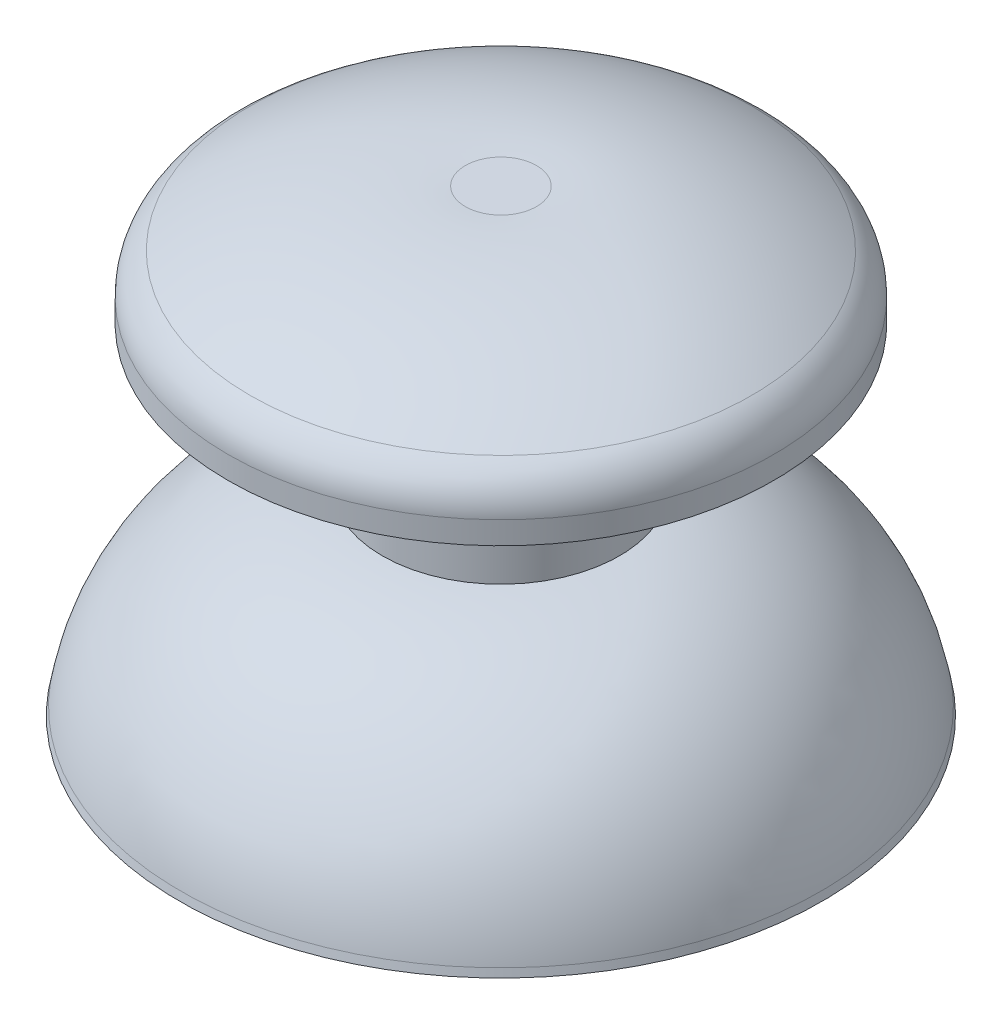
ISO-10303-21;
HEADER;
FILE_DESCRIPTION(('STEP AP214'),'2;1');
FILE_NAME('part.step','',(''),(''),'','','');
FILE_SCHEMA(('AUTOMOTIVE_DESIGN { 1 0 10303 214 1 1 1 1 }'));
ENDSEC;
DATA;
#1=APPLICATION_CONTEXT('core data for automotive mechanical design processes');
#2=APPLICATION_PROTOCOL_DEFINITION('international standard','automotive_design',2000,#1);
#3=PRODUCT_CONTEXT('',#1,'mechanical');
#4=PRODUCT('Part','Part','',(#3));
#5=PRODUCT_RELATED_PRODUCT_CATEGORY('part','',(#4));
#6=PRODUCT_DEFINITION_FORMATION('','',#4);
#7=PRODUCT_DEFINITION_CONTEXT('part definition',#1,'design');
#8=PRODUCT_DEFINITION('design','',#6,#7);
#9=PRODUCT_DEFINITION_SHAPE('','',#8);
#10=(LENGTH_UNIT() NAMED_UNIT(*) SI_UNIT(.MILLI.,.METRE.));
#11=(NAMED_UNIT(*) PLANE_ANGLE_UNIT() SI_UNIT($,.RADIAN.));
#12=(NAMED_UNIT(*) SI_UNIT($,.STERADIAN.) SOLID_ANGLE_UNIT());
#13=UNCERTAINTY_MEASURE_WITH_UNIT(LENGTH_MEASURE(1.E-05),#10,'distance_accuracy_value','');
#14=(GEOMETRIC_REPRESENTATION_CONTEXT(3) GLOBAL_UNCERTAINTY_ASSIGNED_CONTEXT((#13)) GLOBAL_UNIT_ASSIGNED_CONTEXT((#10,
#11,#12)) REPRESENTATION_CONTEXT('',''));
#15=CARTESIAN_POINT('',(0.,0.,0.));
#16=DIRECTION('',(0.,0.,1.));
#17=DIRECTION('',(1.,0.,0.));
#18=AXIS2_PLACEMENT_3D('',#15,#16,#17);
#19=CARTESIAN_POINT('',(0.,47.1009103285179,0.));
#20=DIRECTION('',(0.,-1.,0.));
#21=DIRECTION('',(0.,0.,-1.));
#22=AXIS2_PLACEMENT_3D('',#19,#20,#21);
#23=DEGENERATE_TOROIDAL_SURFACE('',#22,2.30924753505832,15.52,.T.);
#24=CARTESIAN_POINT('',(0.,60.239797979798,0.));
#25=DIRECTION('',(0.,-1.,0.));
#26=DIRECTION('',(0.,0.,-1.));
#27=AXIS2_PLACEMENT_3D('',#24,#25,#26);
#28=CIRCLE('',#27,10.57);
#29=CARTESIAN_POINT('',(0.,60.239797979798,-10.57));
#30=VERTEX_POINT('',#29);
#31=EDGE_CURVE('E67',#30,#30,#28,.T.);
#32=ORIENTED_EDGE('',*,*,#31,.F.);
#33=EDGE_LOOP('',(#32));
#34=FACE_BOUND('',#33,.T.);
#35=CARTESIAN_POINT('',(0.,62.599797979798,0.));
#36=DIRECTION('',(0.,-1.,0.));
#37=DIRECTION('',(0.,0.,-1.));
#38=AXIS2_PLACEMENT_3D('',#35,#36,#37);
#39=CIRCLE('',#38,1.5);
#40=CARTESIAN_POINT('',(0.,62.599797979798,-1.5));
#41=VERTEX_POINT('',#40);
#42=EDGE_CURVE('E10',#41,#41,#39,.T.);
#43=ORIENTED_EDGE('',*,*,#42,.T.);
#44=EDGE_LOOP('',(#43));
#45=FACE_BOUND('',#44,.T.);
#46=ADVANCED_FACE('F24',(#34,#45),#23,.T.);
#47=CARTESIAN_POINT('',(6.775,62.599797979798,0.));
#48=DIRECTION('',(0.,-1.,0.));
#49=DIRECTION('',(0.,0.,-1.));
#50=AXIS2_PLACEMENT_3D('',#47,#48,#49);
#51=PLANE('',#50);
#52=ORIENTED_EDGE('',*,*,#42,.F.);
#53=EDGE_LOOP('',(#52));
#54=FACE_BOUND('',#53,.T.);
#55=ADVANCED_FACE('F74',(#54),#51,.F.);
#56=CARTESIAN_POINT('',(6.775,53.429797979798,0.));
#57=DIRECTION('',(0.,-1.,0.));
#58=DIRECTION('',(0.,0.,-1.));
#59=AXIS2_PLACEMENT_3D('',#56,#57,#58);
#60=PLANE('',#59);
#61=CARTESIAN_POINT('',(0.,53.429797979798,0.));
#62=DIRECTION('',(0.,-1.,0.));
#63=DIRECTION('',(0.,0.,-1.));
#64=AXIS2_PLACEMENT_3D('',#61,#62,#63);
#65=CIRCLE('',#64,1.61);
#66=CARTESIAN_POINT('',(0.,53.429797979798,-1.61));
#67=VERTEX_POINT('',#66);
#68=EDGE_CURVE('E30',#67,#67,#65,.T.);
#69=ORIENTED_EDGE('',*,*,#68,.T.);
#70=EDGE_LOOP('',(#69));
#71=FACE_BOUND('',#70,.T.);
#72=ADVANCED_FACE('F78',(#71),#60,.T.);
#73=CARTESIAN_POINT('',(0.,0.,0.));
#74=DIRECTION('',(0.,-1.,0.));
#75=DIRECTION('',(0.,0.,-1.));
#76=AXIS2_PLACEMENT_3D('',#73,#74,#75);
#77=CYLINDRICAL_SURFACE('',#76,1.61);
#78=CARTESIAN_POINT('',(0.,48.509797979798,0.));
#79=DIRECTION('',(0.,-1.,0.));
#80=DIRECTION('',(0.,0.,-1.));
#81=AXIS2_PLACEMENT_3D('',#78,#79,#80);
#82=CIRCLE('',#81,1.61);
#83=CARTESIAN_POINT('',(0.,48.509797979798,-1.61));
#84=VERTEX_POINT('',#83);
#85=EDGE_CURVE('E34',#84,#84,#82,.T.);
#86=ORIENTED_EDGE('',*,*,#85,.T.);
#87=EDGE_LOOP('',(#86));
#88=FACE_BOUND('',#87,.T.);
#89=ORIENTED_EDGE('',*,*,#68,.F.);
#90=EDGE_LOOP('',(#89));
#91=FACE_BOUND('',#90,.T.);
#92=ADVANCED_FACE('F83',(#88,#91),#77,.F.);
#93=CARTESIAN_POINT('',(6.775,48.509797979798,0.));
#94=DIRECTION('',(0.,-1.,0.));
#95=DIRECTION('',(0.,0.,-1.));
#96=AXIS2_PLACEMENT_3D('',#93,#94,#95);
#97=PLANE('',#96);
#98=CARTESIAN_POINT('',(0.,48.509797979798,0.));
#99=DIRECTION('',(0.,-1.,0.));
#100=DIRECTION('',(0.,0.,-1.));
#101=AXIS2_PLACEMENT_3D('',#98,#99,#100);
#102=CIRCLE('',#101,8.82);
#103=CARTESIAN_POINT('',(0.,48.509797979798,-8.82));
#104=VERTEX_POINT('',#103);
#105=EDGE_CURVE('E38',#104,#104,#102,.T.);
#106=ORIENTED_EDGE('',*,*,#105,.T.);
#107=EDGE_LOOP('',(#106));
#108=FACE_BOUND('',#107,.T.);
#109=ORIENTED_EDGE('',*,*,#85,.F.);
#110=EDGE_LOOP('',(#109));
#111=FACE_BOUND('',#110,.T.);
#112=ADVANCED_FACE('F88',(#108,#111),#97,.T.);
#113=CARTESIAN_POINT('',(0.,41.8535641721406,0.));
#114=DIRECTION('',(0.,-1.,0.));
#115=DIRECTION('',(0.,0.,-1.));
#116=AXIS2_PLACEMENT_3D('',#113,#114,#115);
#117=DEGENERATE_TOROIDAL_SURFACE('',#116,3.86171889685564,8.3,.T.);
#118=CARTESIAN_POINT('',(0.,43.599797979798,0.));
#119=DIRECTION('',(0.,-1.,0.));
#120=DIRECTION('',(0.,0.,-1.));
#121=AXIS2_PLACEMENT_3D('',#118,#119,#120);
#122=CIRCLE('',#121,11.9759451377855);
#123=CARTESIAN_POINT('',(0.,43.599797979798,-11.9759451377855));
#124=VERTEX_POINT('',#123);
#125=EDGE_CURVE('E43',#124,#124,#122,.T.);
#126=ORIENTED_EDGE('',*,*,#125,.T.);
#127=EDGE_LOOP('',(#126));
#128=FACE_BOUND('',#127,.T.);
#129=ORIENTED_EDGE('',*,*,#105,.F.);
#130=EDGE_LOOP('',(#129));
#131=FACE_BOUND('',#130,.T.);
#132=ADVANCED_FACE('F92',(#128,#131),#117,.F.);
#133=CARTESIAN_POINT('',(0.,43.599797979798,0.));
#134=DIRECTION('',(0.,-1.,0.));
#135=DIRECTION('',(0.,0.,-1.));
#136=AXIS2_PLACEMENT_3D('',#133,#134,#135);
#137=CONICAL_SURFACE('',#136,11.9759451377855,0.191721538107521);
#138=CARTESIAN_POINT('',(0.,43.269797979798,0.));
#139=DIRECTION('',(0.,-1.,0.));
#140=DIRECTION('',(0.,0.,-1.));
#141=AXIS2_PLACEMENT_3D('',#138,#139,#140);
#142=CIRCLE('',#141,12.04);
#143=CARTESIAN_POINT('',(0.,43.269797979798,-12.04));
#144=VERTEX_POINT('',#143);
#145=EDGE_CURVE('E46',#144,#144,#142,.T.);
#146=ORIENTED_EDGE('',*,*,#145,.T.);
#147=EDGE_LOOP('',(#146));
#148=FACE_BOUND('',#147,.T.);
#149=ORIENTED_EDGE('',*,*,#125,.F.);
#150=EDGE_LOOP('',(#149));
#151=FACE_BOUND('',#150,.T.);
#152=ADVANCED_FACE('F96',(#148,#151),#137,.F.);
#153=CARTESIAN_POINT('',(6.775,43.269797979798,0.));
#154=DIRECTION('',(0.,-1.,0.));
#155=DIRECTION('',(0.,0.,-1.));
#156=AXIS2_PLACEMENT_3D('',#153,#154,#155);
#157=PLANE('',#156);
#158=CARTESIAN_POINT('',(0.,43.269797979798,0.));
#159=DIRECTION('',(0.,-1.,0.));
#160=DIRECTION('',(0.,0.,-1.));
#161=AXIS2_PLACEMENT_3D('',#158,#159,#160);
#162=CIRCLE('',#161,13.55);
#163=CARTESIAN_POINT('',(0.,43.269797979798,-13.55));
#164=VERTEX_POINT('',#163);
#165=EDGE_CURVE('E49',#164,#164,#162,.T.);
#166=ORIENTED_EDGE('',*,*,#165,.T.);
#167=EDGE_LOOP('',(#166));
#168=FACE_BOUND('',#167,.T.);
#169=ORIENTED_EDGE('',*,*,#145,.F.);
#170=EDGE_LOOP('',(#169));
#171=FACE_BOUND('',#170,.T.);
#172=ADVANCED_FACE('F100',(#168,#171),#157,.T.);
#173=CARTESIAN_POINT('',(0.,43.599797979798,0.));
#174=DIRECTION('',(0.,-1.,0.));
#175=DIRECTION('',(0.,0.,-1.));
#176=AXIS2_PLACEMENT_3D('',#173,#174,#175);
#177=CONICAL_SURFACE('',#176,13.4859451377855,0.191721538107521);
#178=ORIENTED_EDGE('',*,*,#165,.F.);
#179=EDGE_LOOP('',(#178));
#180=FACE_BOUND('',#179,.T.);
#181=CARTESIAN_POINT('',(0.,43.599797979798,0.));
#182=DIRECTION('',(0.,-1.,0.));
#183=DIRECTION('',(0.,0.,-1.));
#184=AXIS2_PLACEMENT_3D('',#181,#182,#183);
#185=CIRCLE('',#184,13.4859451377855);
#186=CARTESIAN_POINT('',(0.,43.599797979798,-13.4859451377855));
#187=VERTEX_POINT('',#186);
#188=EDGE_CURVE('E52',#187,#187,#185,.T.);
#189=ORIENTED_EDGE('',*,*,#188,.T.);
#190=EDGE_LOOP('',(#189));
#191=FACE_BOUND('',#190,.T.);
#192=ADVANCED_FACE('F104',(#180,#191),#177,.T.);
#193=CARTESIAN_POINT('',(0.,41.8686870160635,0.));
#194=DIRECTION('',(0.,-1.,0.));
#195=DIRECTION('',(0.,0.,-1.));
#196=AXIS2_PLACEMENT_3D('',#193,#194,#195);
#197=DEGENERATE_TOROIDAL_SURFACE('',#196,3.84005197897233,9.8,.T.);
#198=ORIENTED_EDGE('',*,*,#188,.F.);
#199=EDGE_LOOP('',(#198));
#200=FACE_BOUND('',#199,.T.);
#201=CARTESIAN_POINT('',(0.,51.599797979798,0.));
#202=DIRECTION('',(0.,-1.,0.));
#203=DIRECTION('',(0.,0.,-1.));
#204=AXIS2_PLACEMENT_3D('',#201,#202,#203);
#205=CIRCLE('',#204,5.);
#206=CARTESIAN_POINT('',(0.,51.599797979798,-5.));
#207=VERTEX_POINT('',#206);
#208=EDGE_CURVE('E55',#207,#207,#205,.T.);
#209=ORIENTED_EDGE('',*,*,#208,.T.);
#210=EDGE_LOOP('',(#209));
#211=FACE_BOUND('',#210,.T.);
#212=ADVANCED_FACE('F108',(#200,#211),#197,.T.);
#213=CARTESIAN_POINT('',(0.,0.,0.));
#214=DIRECTION('',(0.,-1.,0.));
#215=DIRECTION('',(0.,0.,-1.));
#216=AXIS2_PLACEMENT_3D('',#213,#214,#215);
#217=CYLINDRICAL_SURFACE('',#216,5.);
#218=ORIENTED_EDGE('',*,*,#208,.F.);
#219=EDGE_LOOP('',(#218));
#220=FACE_BOUND('',#219,.T.);
#221=CARTESIAN_POINT('',(0.,57.599797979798,0.));
#222=DIRECTION('',(0.,-1.,0.));
#223=DIRECTION('',(0.,0.,-1.));
#224=AXIS2_PLACEMENT_3D('',#221,#222,#223);
#225=CIRCLE('',#224,5.);
#226=CARTESIAN_POINT('',(0.,57.599797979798,-5.));
#227=VERTEX_POINT('',#226);
#228=EDGE_CURVE('E58',#227,#227,#225,.T.);
#229=ORIENTED_EDGE('',*,*,#228,.T.);
#230=EDGE_LOOP('',(#229));
#231=FACE_BOUND('',#230,.T.);
#232=ADVANCED_FACE('F112',(#220,#231),#217,.T.);
#233=CARTESIAN_POINT('',(6.775,57.599797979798,0.));
#234=DIRECTION('',(0.,1.,0.));
#235=DIRECTION('',(0.,0.,1.));
#236=AXIS2_PLACEMENT_3D('',#233,#234,#235);
#237=PLANE('',#236);
#238=ORIENTED_EDGE('',*,*,#228,.F.);
#239=EDGE_LOOP('',(#238));
#240=FACE_BOUND('',#239,.T.);
#241=CARTESIAN_POINT('',(0.,57.599797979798,0.));
#242=DIRECTION('',(0.,-1.,0.));
#243=DIRECTION('',(0.,0.,-1.));
#244=AXIS2_PLACEMENT_3D('',#241,#242,#243);
#245=CIRCLE('',#244,11.5);
#246=CARTESIAN_POINT('',(0.,57.599797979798,-11.5));
#247=VERTEX_POINT('',#246);
#248=EDGE_CURVE('E61',#247,#247,#245,.T.);
#249=ORIENTED_EDGE('',*,*,#248,.T.);
#250=EDGE_LOOP('',(#249));
#251=FACE_BOUND('',#250,.T.);
#252=ADVANCED_FACE('F116',(#240,#251),#237,.F.);
#253=CARTESIAN_POINT('',(0.,0.,0.));
#254=DIRECTION('',(0.,-1.,0.));
#255=DIRECTION('',(0.,0.,-1.));
#256=AXIS2_PLACEMENT_3D('',#253,#254,#255);
#257=CYLINDRICAL_SURFACE('',#256,11.5);
#258=ORIENTED_EDGE('',*,*,#248,.F.);
#259=EDGE_LOOP('',(#258));
#260=FACE_BOUND('',#259,.T.);
#261=CARTESIAN_POINT('',(0.,58.549797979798,0.));
#262=DIRECTION('',(0.,-1.,0.));
#263=DIRECTION('',(0.,0.,-1.));
#264=AXIS2_PLACEMENT_3D('',#261,#262,#263);
#265=CIRCLE('',#264,11.5);
#266=CARTESIAN_POINT('',(0.,58.549797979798,-11.5));
#267=VERTEX_POINT('',#266);
#268=EDGE_CURVE('E64',#267,#267,#265,.T.);
#269=ORIENTED_EDGE('',*,*,#268,.T.);
#270=EDGE_LOOP('',(#269));
#271=FACE_BOUND('',#270,.T.);
#272=ADVANCED_FACE('F120',(#260,#271),#257,.T.);
#273=CARTESIAN_POINT('',(0.,58.5500938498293,0.));
#274=DIRECTION('',(0.,-1.,0.));
#275=DIRECTION('',(0.,0.,-1.));
#276=AXIS2_PLACEMENT_3D('',#273,#274,#275);
#277=TOROIDAL_SURFACE('',#276,9.50000002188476,2.);
#278=ORIENTED_EDGE('',*,*,#268,.F.);
#279=EDGE_LOOP('',(#278));
#280=FACE_BOUND('',#279,.T.);
#281=ORIENTED_EDGE('',*,*,#31,.T.);
#282=EDGE_LOOP('',(#281));
#283=FACE_BOUND('',#282,.T.);
#284=ADVANCED_FACE('F71',(#280,#283),#277,.T.);
#285=CLOSED_SHELL('',(#46,#55,#72,#92,#112,#132,#152,#172,#192,#212,#232,#252,#272,#284));
#286=MANIFOLD_SOLID_BREP('B2',#285);
#287=ADVANCED_BREP_SHAPE_REPRESENTATION('',(#18,#286),#14);
#288=SHAPE_DEFINITION_REPRESENTATION(#9,#287);
ENDSEC;
END-ISO-10303-21;
